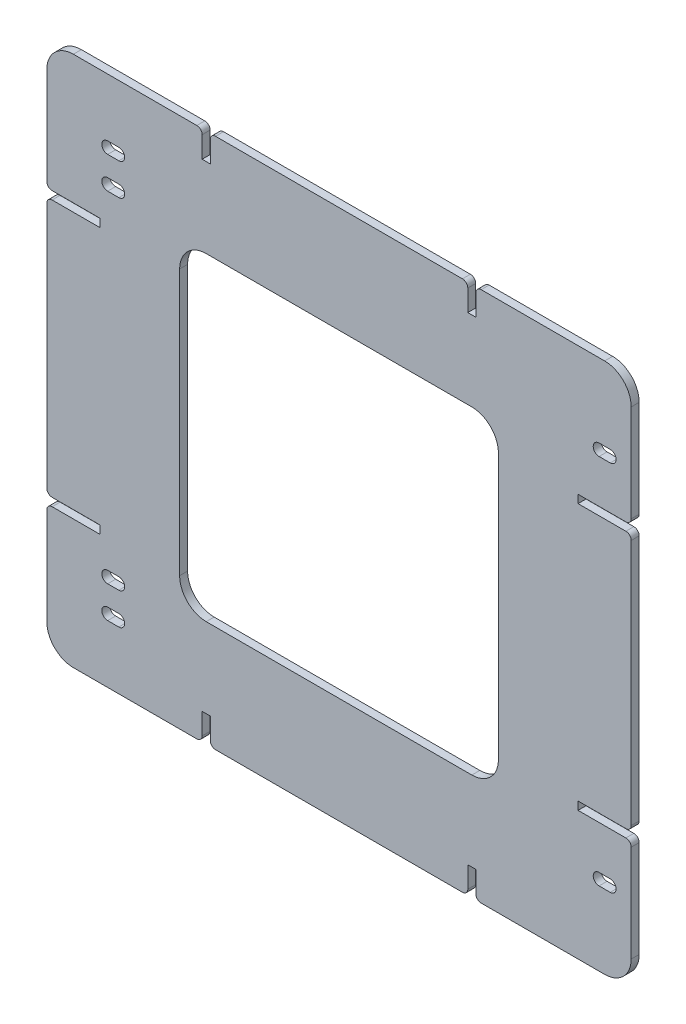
from build123d import *

# Parameters (mm, degrees)
SKETCH_1_W              = 220
SKETCH_1_H              = 200
EXTRUDE_1_DEPTH         = 3
HOLE_WIZARD_4_2_4_2_1_D = 4.2
FILLET_1_R              = 10
SKETCH_4_W              = 120
SKETCH_4_H              = 120
CUT_EXTRUDE_1_DEPTH     = 3
FILLET_2_R              = 10
SKETCH_5_W              = 40
SKETCH_5_H              = 3.05
SKETCH_5_W_2            = 3.05
SKETCH_5_H_2            = 20
CUT_EXTRUDE_2_DEPTH     = 3
FILLET_4_R              = 2
FILLET_5_R              = 2
CUT_EXTRUDE_3_DEPTH     = 10


with BuildPart() as part:
    # Sketch 1 → Extrude 1 (new body)
    with BuildSketch(Plane.XY):
        Rectangle(SKETCH_1_W, SKETCH_1_H)
    extrude(amount=EXTRUDE_1_DEPTH)

    # Hole Wizard 4.2 _4.2_ _1 (through all)
    with Locations(Plane.XY.offset(3)):
        with Locations((-85, 76), (-85, 64), (-85, -76), (-85, -64), (100, -70), (100, 70)):
            Hole(HOLE_WIZARD_4_2_4_2_1_D / 2)

    # Fillet 1
    fillet_1_edges = [part.edges().sort_by_distance(p)[0] for p in [
        (110, -100, 1.5),
        (-110, -100, 1.5),
        (-110, 100, 1.5),
        (110, 100, 1.5),
    ]]
    fillet(fillet_1_edges, radius=FILLET_1_R)

    # Sketch 4 → Cut-Extrude 1 (cut)
    with BuildSketch(Plane.XY.offset(3)):
        Rectangle(SKETCH_4_W, SKETCH_4_H)
    extrude(amount=-CUT_EXTRUDE_1_DEPTH, mode=Mode.SUBTRACT)

    # Fillet 2
    fillet_2_edges = [part.edges().sort_by_distance(p)[0] for p in [
        (60, 60, 1.5),
        (60, -60, 1.5),
        (-60, -60, 1.5),
        (-60, 60, 1.5),
    ]]
    fillet(fillet_2_edges, radius=FILLET_2_R)

    # Sketch 5 → Cut-Extrude 2 (cut)
    with BuildSketch(Plane.XY.offset(3)):
        with Locations((-110, 50)):
            Rectangle(SKETCH_5_W, SKETCH_5_H)
        with Locations((-110, -50)):
            Rectangle(SKETCH_5_W, SKETCH_5_H)
        with Locations((-50, -100)):
            Rectangle(SKETCH_5_W_2, SKETCH_5_H_2)
        with Locations((50, -100)):
            Rectangle(SKETCH_5_W_2, SKETCH_5_H_2)
        with Locations((110, -50)):
            Rectangle(SKETCH_5_W, SKETCH_5_H)
        with Locations((110, 50)):
            Rectangle(SKETCH_5_W, SKETCH_5_H)
        with Locations((50, 100)):
            Rectangle(SKETCH_5_W_2, SKETCH_5_H_2)
        with Locations((-50, 100)):
            Rectangle(SKETCH_5_W_2, SKETCH_5_H_2)
    extrude(amount=-CUT_EXTRUDE_2_DEPTH, mode=Mode.SUBTRACT)

    # Fillet 4
    fillet_4_edges = [part.edges().sort_by_distance(p)[0] for p in [
        (-110, 48.475, 1.5),
        (-110, 51.525, 1.5),
        (51.525, -100, 1.5),
        (48.475, -100, 1.5),
        (-48.475, -100, 1.5),
        (-51.525, -100, 1.5),
        (-110, -51.525, 1.5),
        (-110, -48.475, 1.5),
    ]]
    fillet(fillet_4_edges, radius=FILLET_4_R)

    # Fillet 5
    fillet_5_edges = [part.edges().sort_by_distance(p)[0] for p in [
        (-51.525, 100, 1.5),
        (-48.475, 100, 1.5),
        (48.475, 100, 1.5),
        (51.525, 100, 1.5),
        (110, 48.475, 1.5),
        (110, 51.525, 1.5),
        (110, -51.525, 1.5),
        (110, -48.475, 1.5),
    ]]
    fillet(fillet_5_edges, radius=FILLET_5_R)

    # Sketch 6 → Cut-Extrude 3 (cut)
    with BuildSketch(Plane.XY.offset(3)):
        with BuildLine():
            Line((-87.1, 78.2), (-82.9, 78.2))
            ThreePointArc((-82.9, 78.2), (-80.7, 76), (-82.9, 73.8))
            Line((-82.9, 73.8), (-87.1, 73.8))
            ThreePointArc((-87.1, 73.8), (-89.3, 76), (-87.1, 78.2))
        make_face()
        with BuildLine():
            Line((97.9, 72.2), (102.1, 72.2))
            ThreePointArc((102.1, 72.2), (104.3, 70), (102.1, 67.8))
            Line((102.1, 67.8), (97.9, 67.8))
            ThreePointArc((97.9, 67.8), (95.7, 70), (97.9, 72.2))
        make_face()
        with BuildLine():
            Line((97.9, -67.8), (102.1, -67.8))
            ThreePointArc((102.1, -67.8), (104.3, -70), (102.1, -72.2))
            Line((102.1, -72.2), (97.9, -72.2))
            ThreePointArc((97.9, -72.2), (95.7, -70), (97.9, -67.8))
        make_face()
        with BuildLine():
            Line((-87.1, -61.8), (-82.9, -61.8))
            ThreePointArc((-82.9, -61.8), (-80.7, -64), (-82.9, -66.2))
            Line((-82.9, -66.2), (-87.1, -66.2))
            ThreePointArc((-87.1, -66.2), (-89.3, -64), (-87.1, -61.8))
        make_face()
        with BuildLine():
            Line((-87.1, -73.8), (-82.9, -73.8))
            ThreePointArc((-82.9, -73.8), (-80.7, -76), (-82.9, -78.2))
            Line((-82.9, -78.2), (-87.1, -78.2))
            ThreePointArc((-87.1, -78.2), (-89.3, -76), (-87.1, -73.8))
        make_face()
        with BuildLine():
            Line((-87.1, 66.2), (-82.9, 66.2))
            ThreePointArc((-82.9, 66.2), (-80.7, 64), (-82.9, 61.8))
            Line((-82.9, 61.8), (-87.1, 61.8))
            ThreePointArc((-87.1, 61.8), (-89.3, 64), (-87.1, 66.2))
        make_face()
    extrude(amount=-CUT_EXTRUDE_3_DEPTH, mode=Mode.SUBTRACT)


solid = part.part
